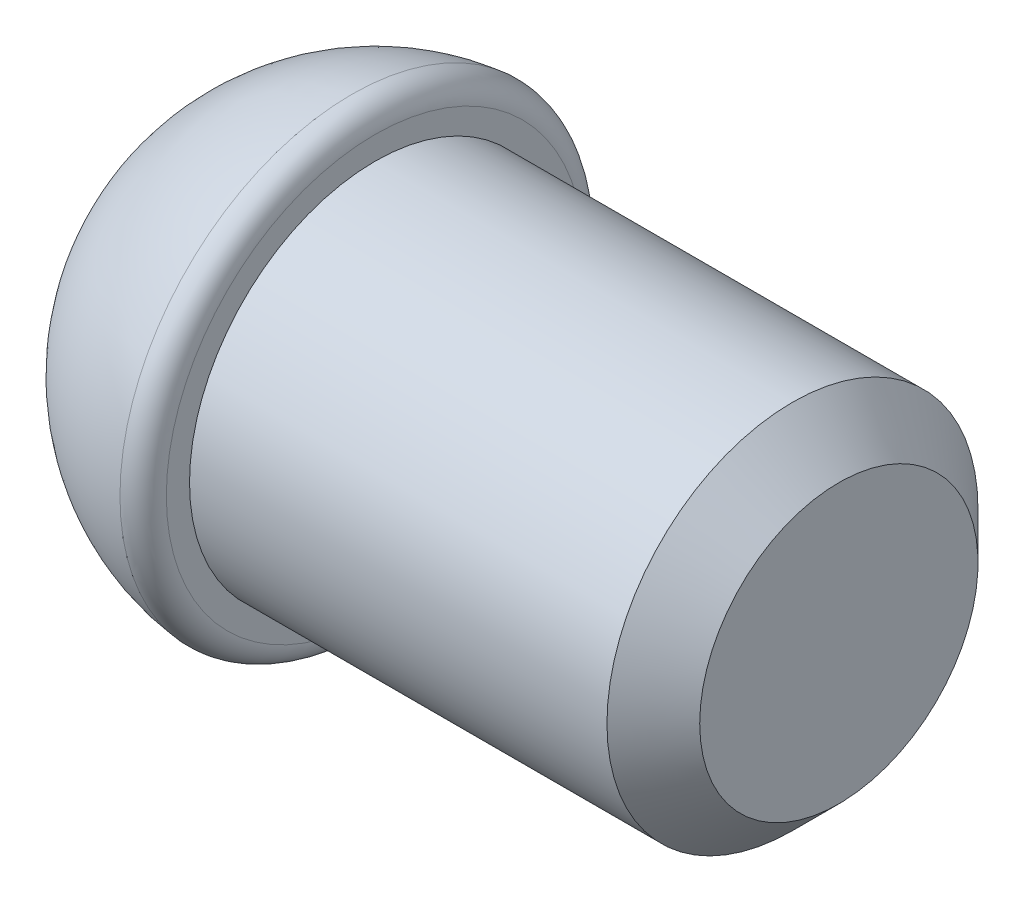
ISO-10303-21;
HEADER;
FILE_DESCRIPTION(('STEP AP214'),'2;1');
FILE_NAME('part.step','',(''),(''),'','','');
FILE_SCHEMA(('AUTOMOTIVE_DESIGN { 1 0 10303 214 1 1 1 1 }'));
ENDSEC;
DATA;
#1=APPLICATION_CONTEXT('core data for automotive mechanical design processes');
#2=APPLICATION_PROTOCOL_DEFINITION('international standard','automotive_design',2000,#1);
#3=PRODUCT_CONTEXT('',#1,'mechanical');
#4=PRODUCT('Part','Part','',(#3));
#5=PRODUCT_RELATED_PRODUCT_CATEGORY('part','',(#4));
#6=PRODUCT_DEFINITION_FORMATION('','',#4);
#7=PRODUCT_DEFINITION_CONTEXT('part definition',#1,'design');
#8=PRODUCT_DEFINITION('design','',#6,#7);
#9=PRODUCT_DEFINITION_SHAPE('','',#8);
#10=(LENGTH_UNIT() NAMED_UNIT(*) SI_UNIT(.MILLI.,.METRE.));
#11=(NAMED_UNIT(*) PLANE_ANGLE_UNIT() SI_UNIT($,.RADIAN.));
#12=(NAMED_UNIT(*) SI_UNIT($,.STERADIAN.) SOLID_ANGLE_UNIT());
#13=UNCERTAINTY_MEASURE_WITH_UNIT(LENGTH_MEASURE(1.E-05),#10,'distance_accuracy_value','');
#14=(GEOMETRIC_REPRESENTATION_CONTEXT(3) GLOBAL_UNCERTAINTY_ASSIGNED_CONTEXT((#13)) GLOBAL_UNIT_ASSIGNED_CONTEXT((#10,
#11,#12)) REPRESENTATION_CONTEXT('',''));
#15=CARTESIAN_POINT('',(0.,0.,0.));
#16=DIRECTION('',(0.,0.,1.));
#17=DIRECTION('',(1.,0.,0.));
#18=AXIS2_PLACEMENT_3D('',#15,#16,#17);
#19=CARTESIAN_POINT('',(0.,1.,0.));
#20=DIRECTION('',(1.,0.,0.));
#21=DIRECTION('',(0.,0.,-1.));
#22=AXIS2_PLACEMENT_3D('',#19,#20,#21);
#23=PLANE('',#22);
#24=CARTESIAN_POINT('',(0.,0.,0.));
#25=DIRECTION('',(1.,0.,0.));
#26=DIRECTION('',(0.,0.,-1.));
#27=AXIS2_PLACEMENT_3D('',#24,#25,#26);
#28=CIRCLE('',#27,0.00501256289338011);
#29=CARTESIAN_POINT('',(0.,0.,-0.00501256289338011));
#30=VERTEX_POINT('',#29);
#31=EDGE_CURVE('E10',#30,#30,#28,.F.);
#32=ORIENTED_EDGE('',*,*,#31,.T.);
#33=EDGE_LOOP('',(#32));
#34=FACE_BOUND('',#33,.T.);
#35=ADVANCED_FACE('F28',(#34),#23,.F.);
#36=CARTESIAN_POINT('',(3.,0.,0.));
#37=DIRECTION('',(-1.,0.,0.));
#38=DIRECTION('',(0.,0.,1.));
#39=AXIS2_PLACEMENT_3D('',#36,#37,#38);
#40=PLANE('',#39);
#41=CARTESIAN_POINT('',(3.,0.,0.));
#42=DIRECTION('',(-1.,0.,0.));
#43=DIRECTION('',(0.,0.,1.));
#44=AXIS2_PLACEMENT_3D('',#41,#42,#43);
#45=CIRCLE('',#44,0.599999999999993);
#46=CARTESIAN_POINT('',(3.,0.,0.599999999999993));
#47=VERTEX_POINT('',#46);
#48=EDGE_CURVE('E35',#47,#47,#45,.F.);
#49=ORIENTED_EDGE('',*,*,#48,.T.);
#50=EDGE_LOOP('',(#49));
#51=FACE_BOUND('',#50,.T.);
#52=ADVANCED_FACE('F59',(#51),#40,.F.);
#53=CARTESIAN_POINT('',(0.,0.,0.));
#54=DIRECTION('',(-1.,0.,0.));
#55=DIRECTION('',(0.,0.,1.));
#56=AXIS2_PLACEMENT_3D('',#53,#54,#55);
#57=CYLINDRICAL_SURFACE('',#56,0.799999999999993);
#58=CARTESIAN_POINT('',(2.8,0.,0.));
#59=DIRECTION('',(-1.,0.,0.));
#60=DIRECTION('',(0.,0.,1.));
#61=AXIS2_PLACEMENT_3D('',#58,#59,#60);
#62=CIRCLE('',#61,0.799999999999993);
#63=CARTESIAN_POINT('',(2.8,0.,0.799999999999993));
#64=VERTEX_POINT('',#63);
#65=EDGE_CURVE('E39',#64,#64,#62,.T.);
#66=ORIENTED_EDGE('',*,*,#65,.T.);
#67=EDGE_LOOP('',(#66));
#68=FACE_BOUND('',#67,.T.);
#69=CARTESIAN_POINT('',(1.,0.,0.));
#70=DIRECTION('',(-1.,0.,0.));
#71=DIRECTION('',(0.,0.,1.));
#72=AXIS2_PLACEMENT_3D('',#69,#70,#71);
#73=CIRCLE('',#72,0.799999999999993);
#74=CARTESIAN_POINT('',(1.,0.,0.799999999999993));
#75=VERTEX_POINT('',#74);
#76=EDGE_CURVE('E51',#75,#75,#73,.T.);
#77=ORIENTED_EDGE('',*,*,#76,.F.);
#78=EDGE_LOOP('',(#77));
#79=FACE_BOUND('',#78,.T.);
#80=ADVANCED_FACE('F57',(#68,#79),#57,.T.);
#81=CARTESIAN_POINT('',(1.,0.799999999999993,0.));
#82=DIRECTION('',(-1.,0.,0.));
#83=DIRECTION('',(0.,0.,1.));
#84=AXIS2_PLACEMENT_3D('',#81,#82,#83);
#85=PLANE('',#84);
#86=CARTESIAN_POINT('',(1.,0.,0.));
#87=DIRECTION('',(-1.,0.,0.));
#88=DIRECTION('',(0.,0.,1.));
#89=AXIS2_PLACEMENT_3D('',#86,#87,#88);
#90=CIRCLE('',#89,0.9);
#91=CARTESIAN_POINT('',(1.,0.,0.9));
#92=VERTEX_POINT('',#91);
#93=EDGE_CURVE('E43',#92,#92,#90,.F.);
#94=ORIENTED_EDGE('',*,*,#93,.T.);
#95=EDGE_LOOP('',(#94));
#96=FACE_BOUND('',#95,.T.);
#97=ORIENTED_EDGE('',*,*,#76,.T.);
#98=EDGE_LOOP('',(#97));
#99=FACE_BOUND('',#98,.T.);
#100=ADVANCED_FACE('F55',(#96,#99),#85,.F.);
#101=CARTESIAN_POINT('',(0.9,0.,0.));
#102=DIRECTION('',(-1.,0.,0.));
#103=DIRECTION('',(0.,0.,1.));
#104=AXIS2_PLACEMENT_3D('',#101,#102,#103);
#105=TOROIDAL_SURFACE('',#104,0.9,0.1);
#106=ORIENTED_EDGE('',*,*,#93,.F.);
#107=EDGE_LOOP('',(#106));
#108=FACE_BOUND('',#107,.T.);
#109=CARTESIAN_POINT('',(0.9,0.,0.));
#110=DIRECTION('',(-1.,0.,0.));
#111=DIRECTION('',(0.,0.,1.));
#112=AXIS2_PLACEMENT_3D('',#109,#110,#111);
#113=CIRCLE('',#112,1.);
#114=CARTESIAN_POINT('',(0.9,0.,1.));
#115=VERTEX_POINT('',#114);
#116=EDGE_CURVE('E48',#115,#115,#113,.T.);
#117=ORIENTED_EDGE('',*,*,#116,.F.);
#118=EDGE_LOOP('',(#117));
#119=FACE_BOUND('',#118,.T.);
#120=ADVANCED_FACE('F66',(#108,#119),#105,.T.);
#121=CARTESIAN_POINT('',(2.8,0.,0.));
#122=DIRECTION('',(-1.,0.,0.));
#123=DIRECTION('',(0.,0.,1.));
#124=AXIS2_PLACEMENT_3D('',#121,#122,#123);
#125=CONICAL_SURFACE('',#124,0.799999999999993,0.78539816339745);
#126=ORIENTED_EDGE('',*,*,#48,.F.);
#127=EDGE_LOOP('',(#126));
#128=FACE_BOUND('',#127,.T.);
#129=ORIENTED_EDGE('',*,*,#65,.F.);
#130=EDGE_LOOP('',(#129));
#131=FACE_BOUND('',#130,.T.);
#132=ADVANCED_FACE('F76',(#128,#131),#125,.T.);
#133=CARTESIAN_POINT('',(1.,0.,0.));
#134=DIRECTION('',(-1.,0.,0.));
#135=DIRECTION('',(0.,0.,1.));
#136=AXIS2_PLACEMENT_3D('',#133,#134,#135);
#137=DEGENERATE_TOROIDAL_SURFACE('',#136,0.00501256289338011,1.,.T.);
#138=ORIENTED_EDGE('',*,*,#116,.T.);
#139=EDGE_LOOP('',(#138));
#140=FACE_BOUND('',#139,.T.);
#141=ORIENTED_EDGE('',*,*,#31,.F.);
#142=EDGE_LOOP('',(#141));
#143=FACE_BOUND('',#142,.T.);
#144=ADVANCED_FACE('F30',(#140,#143),#137,.T.);
#145=CLOSED_SHELL('',(#35,#52,#80,#100,#120,#132,#144));
#146=MANIFOLD_SOLID_BREP('B2',#145);
#147=ADVANCED_BREP_SHAPE_REPRESENTATION('',(#18,#146),#14);
#148=SHAPE_DEFINITION_REPRESENTATION(#9,#147);
ENDSEC;
END-ISO-10303-21;
